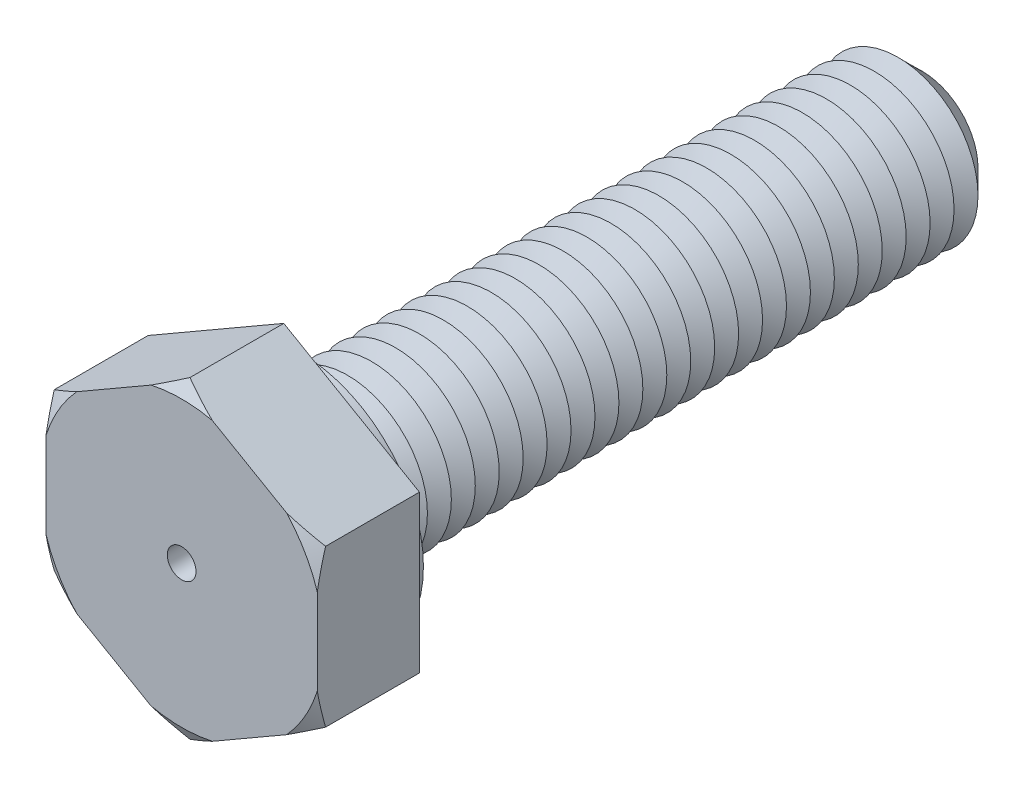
from build123d import *

# Parameters (mm, degrees)
BOSS_EXTRUDE1_DEPTH = 6.4
SKETCH3_R           = 5
BOSS_EXTRUDE2_DEPTH = 40
SKETCH4_R           = 7.75
BOSS_EXTRUDE3_DEPTH = 1
CHAMFER1_SIZE       = 1.5
LPATTERN1_COUNT     = 25
LPATTERN1_PITCH     = 1.5
SKETCH8_R           = 0.9
CUT_EXTRUDE1_DEPTH  = 46.4


with BuildPart() as part:
    # Sketch2 → Boss-Extrude1 (new body)
    with BuildSketch(Plane.XY):
        Polygon((0, 9.814954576), (-8.5, 4.907477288), (-8.5, -4.907477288), (0, -9.814954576), (8.5, -4.907477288), (8.5, 4.907477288), align=None)
    extrude(amount=BOSS_EXTRUDE1_DEPTH)

    # Sketch3 → Boss-Extrude2 (add)
    with BuildSketch(Plane(origin=(0, 0, 0), x_dir=(-1, 0, 0), z_dir=(0, 0, -1))):
        Circle(SKETCH3_R)
    extrude(amount=BOSS_EXTRUDE2_DEPTH)

    # Sketch4 → Boss-Extrude3 (add)
    with BuildSketch(Plane(origin=(0, 0, 0), x_dir=(-1, 0, 0), z_dir=(0, 0, -1))):
        with Locations(Location((0, 0, 0), (0, 0, 180))):
            Circle(SKETCH4_R)
    extrude(amount=BOSS_EXTRUDE3_DEPTH)

    # Chamfer1
    chamfer1_edges = [part.edges().sort_by_distance(p)[0] for p in [
        (5, 0, -40),
    ]]
    chamfer(chamfer1_edges, length=CHAMFER1_SIZE)

    # Sketch6 → Cut-Revolve1 (revolve, cut)
    with BuildSketch(Plane(origin=(0, 0, 0), x_dir=(0, 0, -1), z_dir=(1, 0, 0)), mode=Mode.PRIVATE) as cut_revolve1_sk:
        Polygon((1, 5), (1.75, 3.700961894), (2.5, 5), align=None)
    cut_revolve1 = revolve(cut_revolve1_sk.sketch.rotate(Axis((0, 0, 3.211670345), (0, 0, -1)), 90), axis=Axis((0, 0, 3.211670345), (0, 0, -1)), mode=Mode.SUBTRACT)

    # LPattern1: Cut-Revolve1 ×25
    with Locations(*[(0, 0, -i * LPATTERN1_PITCH) for i in range(1, LPATTERN1_COUNT)]):
        add(cut_revolve1, mode=Mode.SUBTRACT)

    # Sketch7 → Cut-Revolve2 (revolve, cut)
    with BuildSketch(Plane(origin=(0, 0, 0), x_dir=(0, 0, -1), z_dir=(1, 0, 0)), mode=Mode.PRIVATE) as cut_revolve2_sk:
        Polygon((-6.4, 9.814954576), (-6.4, 8.914954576), (-5.880384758, 9.814954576), align=None)
    revolve(cut_revolve2_sk.sketch.rotate(Axis((0, 0, 3.211670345), (0, 0, -1)), 90), axis=Axis((0, 0, 3.211670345), (0, 0, -1)), mode=Mode.SUBTRACT)

    # Sketch8 → Cut-Extrude1 (cut)
    with BuildSketch(Plane.XY.offset(6.4)):
        Circle(SKETCH8_R)
    extrude(amount=-CUT_EXTRUDE1_DEPTH, mode=Mode.SUBTRACT)


solid = part.part
